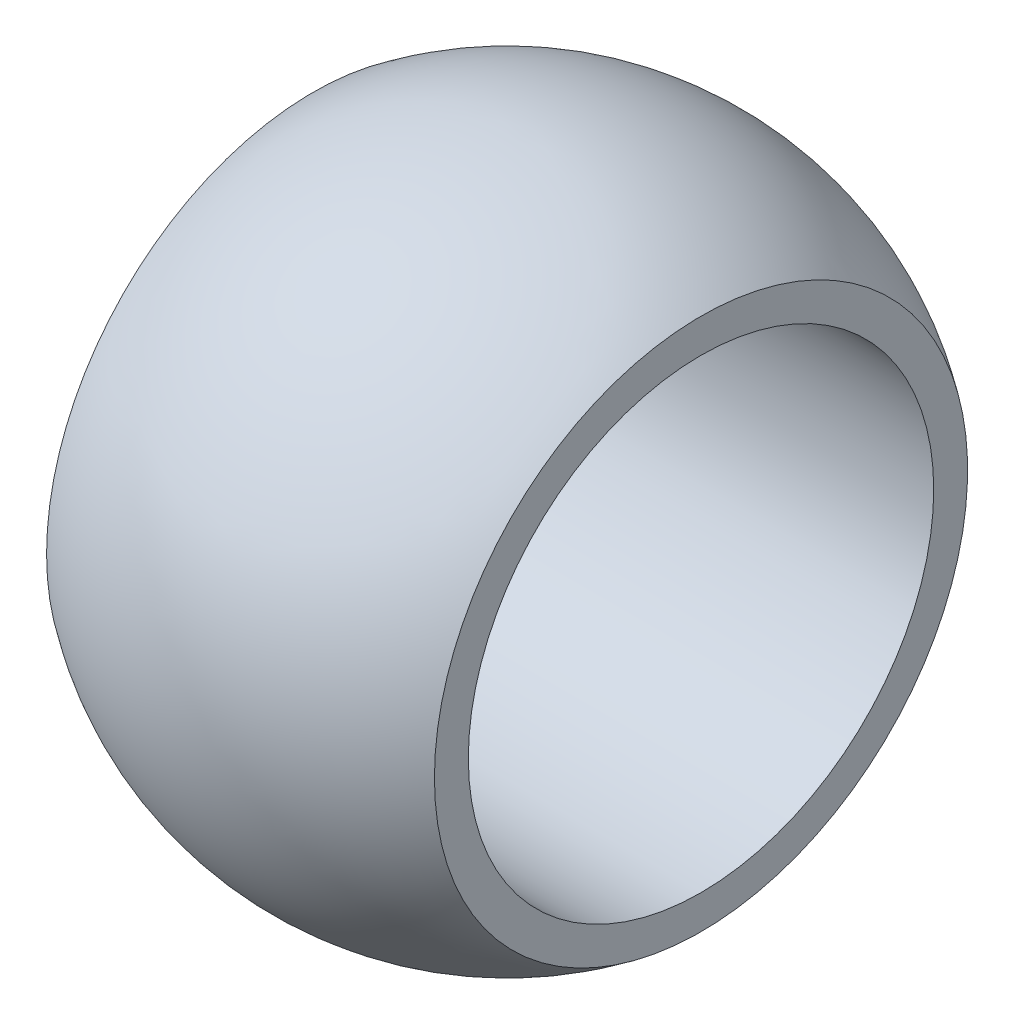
from build123d import *


with BuildPart() as part:
    # Esquisse1 → Base-R_volution (revolve)
    with BuildSketch(Plane.XY, mode=Mode.PRIVATE) as base_r_volution_sk:
        with BuildLine():
            Line((5, 6.873863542), (5, 6))
            Line((5, 6), (-5, 6))
            Line((-5, 6), (-5, 6.873863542))
            ThreePointArc((-5, 6.873863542), (0, 8.5), (5, 6.873863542))
        make_face()
    revolve(base_r_volution_sk.sketch.rotate(Axis((-70, 0, 0), (1, 0, 0)), 90), axis=Axis((-70, 0, 0), (1, 0, 0)))


solid = part.part
